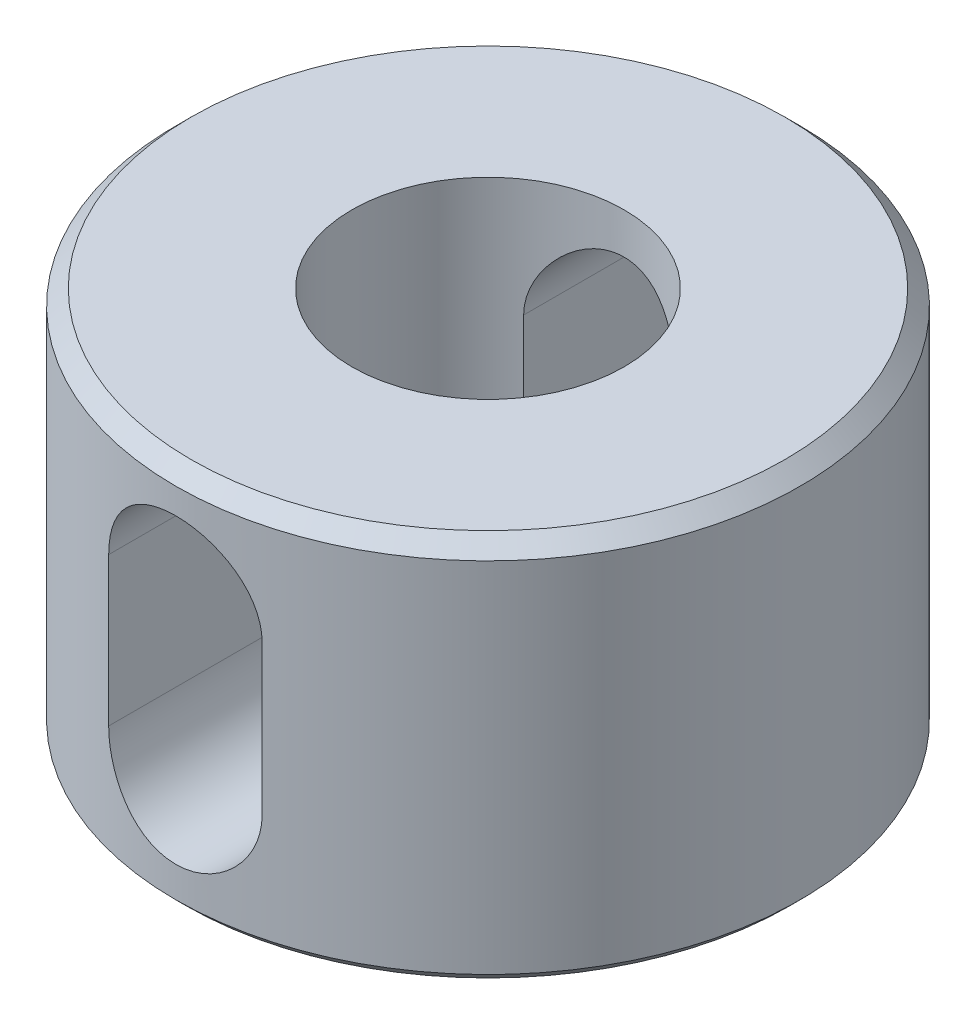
ISO-10303-21;
HEADER;
FILE_DESCRIPTION(('STEP AP214'),'2;1');
FILE_NAME('part.step','',(''),(''),'','','');
FILE_SCHEMA(('AUTOMOTIVE_DESIGN { 1 0 10303 214 1 1 1 1 }'));
ENDSEC;
DATA;
#1=APPLICATION_CONTEXT('core data for automotive mechanical design processes');
#2=APPLICATION_PROTOCOL_DEFINITION('international standard','automotive_design',2000,#1);
#3=PRODUCT_CONTEXT('',#1,'mechanical');
#4=PRODUCT('Part','Part','',(#3));
#5=PRODUCT_RELATED_PRODUCT_CATEGORY('part','',(#4));
#6=PRODUCT_DEFINITION_FORMATION('','',#4);
#7=PRODUCT_DEFINITION_CONTEXT('part definition',#1,'design');
#8=PRODUCT_DEFINITION('design','',#6,#7);
#9=PRODUCT_DEFINITION_SHAPE('','',#8);
#10=(LENGTH_UNIT() NAMED_UNIT(*) SI_UNIT(.MILLI.,.METRE.));
#11=(NAMED_UNIT(*) PLANE_ANGLE_UNIT() SI_UNIT($,.RADIAN.));
#12=(NAMED_UNIT(*) SI_UNIT($,.STERADIAN.) SOLID_ANGLE_UNIT());
#13=UNCERTAINTY_MEASURE_WITH_UNIT(LENGTH_MEASURE(1.E-05),#10,'distance_accuracy_value','');
#14=(GEOMETRIC_REPRESENTATION_CONTEXT(3) GLOBAL_UNCERTAINTY_ASSIGNED_CONTEXT((#13)) GLOBAL_UNIT_ASSIGNED_CONTEXT((#10,
#11,#12)) REPRESENTATION_CONTEXT('',''));
#15=CARTESIAN_POINT('',(0.,0.,0.));
#16=DIRECTION('',(0.,0.,1.));
#17=DIRECTION('',(1.,0.,0.));
#18=AXIS2_PLACEMENT_3D('',#15,#16,#17);
#19=CARTESIAN_POINT('',(0.,9.525,0.));
#20=DIRECTION('',(0.,-1.,0.));
#21=DIRECTION('',(0.,0.,-1.));
#22=AXIS2_PLACEMENT_3D('',#19,#20,#21);
#23=CYLINDRICAL_SURFACE('',#22,7.747);
#24=DIRECTION('',(0.,-1.,0.));
#25=VECTOR('',#24,1.);
#26=CARTESIAN_POINT('',(1.905,9.525,-7.50912671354));
#27=LINE('',#26,#25);
#28=CARTESIAN_POINT('',(1.905,2.921,-7.50912671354));
#29=VERTEX_POINT('',#28);
#30=CARTESIAN_POINT('',(1.905,6.604,-7.50912671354));
#31=VERTEX_POINT('',#30);
#32=EDGE_CURVE('E269',#29,#31,#27,.F.);
#33=ORIENTED_EDGE('',*,*,#32,.T.);
#34=CARTESIAN_POINT('',(1.905,6.604,-7.50912671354));
#35=CARTESIAN_POINT('',(1.90500061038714,6.6567274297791,-7.50912324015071));
#36=CARTESIAN_POINT('',(1.90280948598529,6.70942876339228,-7.50968278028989));
#37=CARTESIAN_POINT('',(1.89407453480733,6.81443787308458,-7.51189196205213));
#38=CARTESIAN_POINT('',(1.88753142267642,6.86674571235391,-7.5135414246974));
#39=CARTESIAN_POINT('',(1.86146822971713,7.02230024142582,-7.5200588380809));
#40=CARTESIAN_POINT('',(1.83551388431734,7.12447892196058,-7.52649621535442));
#41=CARTESIAN_POINT('',(1.76728311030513,7.32285711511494,-7.54280668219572));
#42=CARTESIAN_POINT('',(1.72500791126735,7.41905707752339,-7.552679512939));
#43=CARTESIAN_POINT('',(1.62538466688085,7.60304588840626,-7.57474279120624));
#44=CARTESIAN_POINT('',(1.56803280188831,7.69083259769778,-7.58693382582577));
#45=CARTESIAN_POINT('',(1.43859506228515,7.85731545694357,-7.61254728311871));
#46=CARTESIAN_POINT('',(1.36624936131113,7.93580661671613,-7.6259887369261));
#47=CARTESIAN_POINT('',(1.209430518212,8.07967858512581,-7.65242443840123));
#48=CARTESIAN_POINT('',(1.12495544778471,8.14505730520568,-7.66541861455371));
#49=CARTESIAN_POINT('',(0.944870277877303,8.26168048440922,-7.68970621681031));
#50=CARTESIAN_POINT('',(0.849125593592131,8.31272283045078,-7.70097439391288));
#51=CARTESIAN_POINT('',(0.650096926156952,8.39790929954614,-7.72032152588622));
#52=CARTESIAN_POINT('',(0.546814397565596,8.43205667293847,-7.72840109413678));
#53=CARTESIAN_POINT('',(0.337787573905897,8.48182836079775,-7.7403260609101));
#54=CARTESIAN_POINT('',(0.232131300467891,8.49780285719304,-7.74425140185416));
#55=CARTESIAN_POINT('',(0.0195681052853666,8.51187406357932,-7.74770403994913));
#56=CARTESIAN_POINT('',(-0.0873386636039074,8.50997293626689,-7.74723186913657));
#57=CARTESIAN_POINT('',(-0.296936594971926,8.48859926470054,-7.74200224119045));
#58=CARTESIAN_POINT('',(-0.399668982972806,8.46950502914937,-7.73733704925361));
#59=CARTESIAN_POINT('',(-0.600423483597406,8.41489471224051,-7.72435273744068));
#60=CARTESIAN_POINT('',(-0.698445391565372,8.37937791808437,-7.71603345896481));
#61=CARTESIAN_POINT('',(-0.888002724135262,8.29262024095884,-7.69653346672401));
#62=CARTESIAN_POINT('',(-0.979473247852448,8.24124331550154,-7.68532814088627));
#63=CARTESIAN_POINT('',(-1.15262550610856,8.12432772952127,-7.66127379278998));
#64=CARTESIAN_POINT('',(-1.23430582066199,8.05878701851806,-7.64842453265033));
#65=CARTESIAN_POINT('',(-1.38780832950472,7.91338098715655,-7.62208815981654));
#66=CARTESIAN_POINT('',(-1.45931763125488,7.83318647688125,-7.60859315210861));
#67=CARTESIAN_POINT('',(-1.58795807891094,7.66177892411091,-7.58279081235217));
#68=CARTESIAN_POINT('',(-1.64508529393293,7.57056287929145,-7.57048380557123));
#69=CARTESIAN_POINT('',(-1.74353569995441,7.37908809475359,-7.54842104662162));
#70=CARTESIAN_POINT('',(-1.78477688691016,7.27878565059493,-7.5386786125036));
#71=CARTESIAN_POINT('',(-1.84966237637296,7.07243407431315,-7.5230240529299));
#72=CARTESIAN_POINT('',(-1.87333296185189,6.96639378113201,-7.51710620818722));
#73=CARTESIAN_POINT('',(-1.89355353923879,6.81686774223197,-7.51202283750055));
#74=CARTESIAN_POINT('',(-1.89784677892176,6.77437933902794,-7.51093842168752));
#75=CARTESIAN_POINT('',(-1.90356674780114,6.68926732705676,-7.50949070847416));
#76=CARTESIAN_POINT('',(-1.9049981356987,6.64664405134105,-7.50912623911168));
#77=CARTESIAN_POINT('',(-1.905,6.604,-7.50912671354));
#78=B_SPLINE_CURVE_WITH_KNOTS('',3,(#34,#35,#36,#37,#38,#39,#40,#41,#42,#43,#44,#45,#46,#47,#48,
#49,#50,#51,#52,#53,#54,#55,#56,#57,#58,#59,#60,#61,#62,#63,#64,#65,#66,#67,#68,#69,#70,#71,#72,
#73,#74,#75,#76,#77),.UNSPECIFIED.,.F.,.F.,(4,2,2,2,2,2,2,2,2,2,2,2,2,2,2,2,2,2,2,2,2,4),(0.,
0.158082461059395,0.316138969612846,0.631360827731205,0.946558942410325,1.26183698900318,
1.58311999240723,1.9044541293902,2.23011385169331,2.55571089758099,2.87492154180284,
3.19409356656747,3.50640982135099,3.81873963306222,4.13382665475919,4.44895932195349,
4.77231592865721,5.09576081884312,5.42085365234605,5.74545921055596,5.87353314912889,
6.00139843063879),.UNSPECIFIED.);
#79=CARTESIAN_POINT('',(-1.905,6.604,-7.50912671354));
#80=VERTEX_POINT('',#79);
#81=EDGE_CURVE('E127',#31,#80,#78,.T.);
#82=ORIENTED_EDGE('',*,*,#81,.T.);
#83=DIRECTION('',(0.,-1.,0.));
#84=VECTOR('',#83,1.);
#85=CARTESIAN_POINT('',(-1.905,9.525,-7.50912671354));
#86=LINE('',#85,#84);
#87=CARTESIAN_POINT('',(-1.905,2.921,-7.50912671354));
#88=VERTEX_POINT('',#87);
#89=EDGE_CURVE('E201',#80,#88,#86,.T.);
#90=ORIENTED_EDGE('',*,*,#89,.T.);
#91=CARTESIAN_POINT('',(-1.905,2.921,-7.50912671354));
#92=CARTESIAN_POINT('',(-1.90500061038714,2.8682725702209,-7.50912324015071));
#93=CARTESIAN_POINT('',(-1.90280948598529,2.81557123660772,-7.50968278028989));
#94=CARTESIAN_POINT('',(-1.89407453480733,2.71056212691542,-7.51189196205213));
#95=CARTESIAN_POINT('',(-1.88753142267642,2.65825428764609,-7.5135414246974));
#96=CARTESIAN_POINT('',(-1.86146822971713,2.50269975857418,-7.5200588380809));
#97=CARTESIAN_POINT('',(-1.83551388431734,2.40052107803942,-7.52649621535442));
#98=CARTESIAN_POINT('',(-1.76728311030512,2.20214288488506,-7.54280668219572));
#99=CARTESIAN_POINT('',(-1.72500791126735,2.10594292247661,-7.552679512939));
#100=CARTESIAN_POINT('',(-1.62538466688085,1.92195411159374,-7.57474279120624));
#101=CARTESIAN_POINT('',(-1.56803280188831,1.83416740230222,-7.58693382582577));
#102=CARTESIAN_POINT('',(-1.43859506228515,1.66768454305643,-7.61254728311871));
#103=CARTESIAN_POINT('',(-1.36624936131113,1.58919338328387,-7.62598873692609));
#104=CARTESIAN_POINT('',(-1.209430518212,1.44532141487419,-7.65242443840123));
#105=CARTESIAN_POINT('',(-1.12495544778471,1.37994269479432,-7.66541861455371));
#106=CARTESIAN_POINT('',(-0.944870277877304,1.26331951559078,-7.68970621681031));
#107=CARTESIAN_POINT('',(-0.849125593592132,1.21227716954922,-7.70097439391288));
#108=CARTESIAN_POINT('',(-0.650096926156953,1.12709070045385,-7.72032152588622));
#109=CARTESIAN_POINT('',(-0.546814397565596,1.09294332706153,-7.72840109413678));
#110=CARTESIAN_POINT('',(-0.337787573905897,1.04317163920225,-7.7403260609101));
#111=CARTESIAN_POINT('',(-0.232131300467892,1.02719714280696,-7.74425140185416));
#112=CARTESIAN_POINT('',(-0.0195681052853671,1.01312593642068,-7.74770403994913));
#113=CARTESIAN_POINT('',(0.0873386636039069,1.01502706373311,-7.74723186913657));
#114=CARTESIAN_POINT('',(0.296936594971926,1.03640073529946,-7.74200224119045));
#115=CARTESIAN_POINT('',(0.399668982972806,1.05549497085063,-7.73733704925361));
#116=CARTESIAN_POINT('',(0.600423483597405,1.11010528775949,-7.72435273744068));
#117=CARTESIAN_POINT('',(0.698445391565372,1.14562208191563,-7.71603345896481));
#118=CARTESIAN_POINT('',(0.888002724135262,1.23237975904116,-7.69653346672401));
#119=CARTESIAN_POINT('',(0.979473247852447,1.28375668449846,-7.68532814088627));
#120=CARTESIAN_POINT('',(1.15262550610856,1.40067227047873,-7.66127379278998));
#121=CARTESIAN_POINT('',(1.23430582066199,1.46621298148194,-7.64842453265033));
#122=CARTESIAN_POINT('',(1.38780832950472,1.61161901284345,-7.62208815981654));
#123=CARTESIAN_POINT('',(1.45931763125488,1.69181352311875,-7.60859315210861));
#124=CARTESIAN_POINT('',(1.58795807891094,1.86322107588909,-7.58279081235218));
#125=CARTESIAN_POINT('',(1.64508529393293,1.95443712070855,-7.57048380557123));
#126=CARTESIAN_POINT('',(1.74353569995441,2.14591190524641,-7.54842104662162));
#127=CARTESIAN_POINT('',(1.78477688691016,2.24621434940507,-7.5386786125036));
#128=CARTESIAN_POINT('',(1.84966237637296,2.45256592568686,-7.5230240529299));
#129=CARTESIAN_POINT('',(1.87333296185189,2.55860621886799,-7.51710620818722));
#130=CARTESIAN_POINT('',(1.89355353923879,2.70813225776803,-7.51202283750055));
#131=CARTESIAN_POINT('',(1.89784677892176,2.75062066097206,-7.51093842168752));
#132=CARTESIAN_POINT('',(1.90356674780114,2.83573267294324,-7.50949070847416));
#133=CARTESIAN_POINT('',(1.9049981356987,2.87835594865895,-7.50912623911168));
#134=CARTESIAN_POINT('',(1.905,2.921,-7.50912671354));
#135=B_SPLINE_CURVE_WITH_KNOTS('',3,(#91,#92,#93,#94,#95,#96,#97,#98,#99,#100,#101,#102,#103,
#104,#105,#106,#107,#108,#109,#110,#111,#112,#113,#114,#115,#116,#117,#118,#119,#120,#121,#122,
#123,#124,#125,#126,#127,#128,#129,#130,#131,#132,#133,#134),.UNSPECIFIED.,.F.,.F.,(4,2,2,2,2,2,
2,2,2,2,2,2,2,2,2,2,2,2,2,2,2,4),(0.,0.158082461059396,0.316138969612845,0.631360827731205,
0.946558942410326,1.26183698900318,1.58311999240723,1.9044541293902,2.23011385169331,
2.55571089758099,2.87492154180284,3.19409356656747,3.50640982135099,3.81873963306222,
4.13382665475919,4.44895932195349,4.77231592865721,5.09576081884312,5.42085365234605,
5.74545921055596,5.87353314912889,6.00139843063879),.UNSPECIFIED.);
#136=EDGE_CURVE('E194',#88,#29,#135,.T.);
#137=ORIENTED_EDGE('',*,*,#136,.T.);
#138=EDGE_LOOP('',(#33,#82,#90,#137));
#139=FACE_BOUND('',#138,.T.);
#140=DIRECTION('',(0.,-1.,0.));
#141=VECTOR('',#140,1.);
#142=CARTESIAN_POINT('',(-1.905,9.525,7.50912671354));
#143=LINE('',#142,#141);
#144=CARTESIAN_POINT('',(-1.905,2.921,7.50912671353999));
#145=VERTEX_POINT('',#144);
#146=CARTESIAN_POINT('',(-1.905,6.604,7.50912671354));
#147=VERTEX_POINT('',#146);
#148=EDGE_CURVE('E258',#145,#147,#143,.F.);
#149=ORIENTED_EDGE('',*,*,#148,.T.);
#150=CARTESIAN_POINT('',(-1.905,6.604,7.50912671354));
#151=CARTESIAN_POINT('',(-1.90500061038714,6.6567274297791,7.50912324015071));
#152=CARTESIAN_POINT('',(-1.90280948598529,6.70942876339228,7.50968278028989));
#153=CARTESIAN_POINT('',(-1.89407453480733,6.81443787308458,7.51189196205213));
#154=CARTESIAN_POINT('',(-1.88753142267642,6.86674571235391,7.5135414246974));
#155=CARTESIAN_POINT('',(-1.86146822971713,7.02230024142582,7.5200588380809));
#156=CARTESIAN_POINT('',(-1.83551388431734,7.12447892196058,7.52649621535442));
#157=CARTESIAN_POINT('',(-1.76728311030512,7.32285711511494,7.54280668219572));
#158=CARTESIAN_POINT('',(-1.72500791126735,7.41905707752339,7.552679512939));
#159=CARTESIAN_POINT('',(-1.62538466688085,7.60304588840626,7.57474279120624));
#160=CARTESIAN_POINT('',(-1.56803280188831,7.69083259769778,7.58693382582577));
#161=CARTESIAN_POINT('',(-1.43859506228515,7.85731545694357,7.61254728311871));
#162=CARTESIAN_POINT('',(-1.36624936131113,7.93580661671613,7.6259887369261));
#163=CARTESIAN_POINT('',(-1.209430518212,8.07967858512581,7.65242443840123));
#164=CARTESIAN_POINT('',(-1.12495544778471,8.14505730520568,7.66541861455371));
#165=CARTESIAN_POINT('',(-0.944870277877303,8.26168048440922,7.68970621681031));
#166=CARTESIAN_POINT('',(-0.849125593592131,8.31272283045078,7.70097439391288));
#167=CARTESIAN_POINT('',(-0.650096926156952,8.39790929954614,7.72032152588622));
#168=CARTESIAN_POINT('',(-0.546814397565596,8.43205667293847,7.72840109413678));
#169=CARTESIAN_POINT('',(-0.337787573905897,8.48182836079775,7.7403260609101));
#170=CARTESIAN_POINT('',(-0.232131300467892,8.49780285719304,7.74425140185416));
#171=CARTESIAN_POINT('',(-0.0195681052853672,8.51187406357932,7.74770403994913));
#172=CARTESIAN_POINT('',(0.0873386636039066,8.50997293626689,7.74723186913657));
#173=CARTESIAN_POINT('',(0.296936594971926,8.48859926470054,7.74200224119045));
#174=CARTESIAN_POINT('',(0.399668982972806,8.46950502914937,7.73733704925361));
#175=CARTESIAN_POINT('',(0.600423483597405,8.41489471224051,7.72435273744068));
#176=CARTESIAN_POINT('',(0.698445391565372,8.37937791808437,7.71603345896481));
#177=CARTESIAN_POINT('',(0.888002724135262,8.29262024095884,7.69653346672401));
#178=CARTESIAN_POINT('',(0.979473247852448,8.24124331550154,7.68532814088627));
#179=CARTESIAN_POINT('',(1.15262550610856,8.12432772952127,7.66127379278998));
#180=CARTESIAN_POINT('',(1.23430582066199,8.05878701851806,7.64842453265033));
#181=CARTESIAN_POINT('',(1.38780832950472,7.91338098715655,7.62208815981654));
#182=CARTESIAN_POINT('',(1.45931763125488,7.83318647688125,7.60859315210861));
#183=CARTESIAN_POINT('',(1.58795807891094,7.66177892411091,7.58279081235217));
#184=CARTESIAN_POINT('',(1.64508529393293,7.57056287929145,7.57048380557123));
#185=CARTESIAN_POINT('',(1.74353569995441,7.37908809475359,7.54842104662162));
#186=CARTESIAN_POINT('',(1.78477688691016,7.27878565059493,7.5386786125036));
#187=CARTESIAN_POINT('',(1.84966237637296,7.07243407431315,7.5230240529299));
#188=CARTESIAN_POINT('',(1.87333296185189,6.96639378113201,7.51710620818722));
#189=CARTESIAN_POINT('',(1.89355353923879,6.81686774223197,7.51202283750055));
#190=CARTESIAN_POINT('',(1.89784677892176,6.77437933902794,7.51093842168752));
#191=CARTESIAN_POINT('',(1.90356674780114,6.68926732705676,7.50949070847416));
#192=CARTESIAN_POINT('',(1.9049981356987,6.64664405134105,7.50912623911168));
#193=CARTESIAN_POINT('',(1.905,6.604,7.50912671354));
#194=B_SPLINE_CURVE_WITH_KNOTS('',3,(#150,#151,#152,#153,#154,#155,#156,#157,#158,#159,#160,
#161,#162,#163,#164,#165,#166,#167,#168,#169,#170,#171,#172,#173,#174,#175,#176,#177,#178,#179,
#180,#181,#182,#183,#184,#185,#186,#187,#188,#189,#190,#191,#192,#193),.UNSPECIFIED.,.F.,.F.,(4,
2,2,2,2,2,2,2,2,2,2,2,2,2,2,2,2,2,2,2,2,4),(0.,0.158082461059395,0.316138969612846,
0.631360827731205,0.946558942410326,1.26183698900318,1.58311999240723,1.9044541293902,
2.23011385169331,2.55571089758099,2.87492154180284,3.19409356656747,3.50640982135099,
3.81873963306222,4.13382665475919,4.44895932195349,4.77231592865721,5.09576081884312,
5.42085365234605,5.74545921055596,5.87353314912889,6.00139843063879),.UNSPECIFIED.);
#195=CARTESIAN_POINT('',(1.905,6.604,7.50912671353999));
#196=VERTEX_POINT('',#195);
#197=EDGE_CURVE('E173',#147,#196,#194,.T.);
#198=ORIENTED_EDGE('',*,*,#197,.T.);
#199=DIRECTION('',(0.,-1.,0.));
#200=VECTOR('',#199,1.);
#201=CARTESIAN_POINT('',(1.905,9.525,7.50912671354));
#202=LINE('',#201,#200);
#203=CARTESIAN_POINT('',(1.905,2.921,7.50912671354));
#204=VERTEX_POINT('',#203);
#205=EDGE_CURVE('E174',#196,#204,#202,.T.);
#206=ORIENTED_EDGE('',*,*,#205,.T.);
#207=CARTESIAN_POINT('',(1.905,2.921,7.50912671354));
#208=CARTESIAN_POINT('',(1.90500061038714,2.8682725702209,7.50912324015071));
#209=CARTESIAN_POINT('',(1.90280948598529,2.81557123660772,7.50968278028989));
#210=CARTESIAN_POINT('',(1.89407453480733,2.71056212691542,7.51189196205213));
#211=CARTESIAN_POINT('',(1.88753142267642,2.65825428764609,7.5135414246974));
#212=CARTESIAN_POINT('',(1.86146822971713,2.50269975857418,7.5200588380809));
#213=CARTESIAN_POINT('',(1.83551388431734,2.40052107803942,7.52649621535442));
#214=CARTESIAN_POINT('',(1.76728311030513,2.20214288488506,7.54280668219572));
#215=CARTESIAN_POINT('',(1.72500791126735,2.10594292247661,7.552679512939));
#216=CARTESIAN_POINT('',(1.62538466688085,1.92195411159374,7.57474279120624));
#217=CARTESIAN_POINT('',(1.56803280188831,1.83416740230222,7.58693382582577));
#218=CARTESIAN_POINT('',(1.43859506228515,1.66768454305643,7.61254728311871));
#219=CARTESIAN_POINT('',(1.36624936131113,1.58919338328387,7.62598873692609));
#220=CARTESIAN_POINT('',(1.209430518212,1.44532141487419,7.65242443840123));
#221=CARTESIAN_POINT('',(1.12495544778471,1.37994269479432,7.66541861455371));
#222=CARTESIAN_POINT('',(0.944870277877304,1.26331951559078,7.68970621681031));
#223=CARTESIAN_POINT('',(0.849125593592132,1.21227716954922,7.70097439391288));
#224=CARTESIAN_POINT('',(0.650096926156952,1.12709070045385,7.72032152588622));
#225=CARTESIAN_POINT('',(0.546814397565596,1.09294332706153,7.72840109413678));
#226=CARTESIAN_POINT('',(0.337787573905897,1.04317163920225,7.7403260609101));
#227=CARTESIAN_POINT('',(0.232131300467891,1.02719714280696,7.74425140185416));
#228=CARTESIAN_POINT('',(0.0195681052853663,1.01312593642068,7.74770403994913));
#229=CARTESIAN_POINT('',(-0.0873386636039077,1.01502706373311,7.74723186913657));
#230=CARTESIAN_POINT('',(-0.296936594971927,1.03640073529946,7.74200224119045));
#231=CARTESIAN_POINT('',(-0.399668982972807,1.05549497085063,7.73733704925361));
#232=CARTESIAN_POINT('',(-0.600423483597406,1.11010528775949,7.72435273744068));
#233=CARTESIAN_POINT('',(-0.698445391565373,1.14562208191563,7.71603345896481));
#234=CARTESIAN_POINT('',(-0.888002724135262,1.23237975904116,7.69653346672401));
#235=CARTESIAN_POINT('',(-0.979473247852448,1.28375668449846,7.68532814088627));
#236=CARTESIAN_POINT('',(-1.15262550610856,1.40067227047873,7.66127379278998));
#237=CARTESIAN_POINT('',(-1.23430582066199,1.46621298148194,7.64842453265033));
#238=CARTESIAN_POINT('',(-1.38780832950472,1.61161901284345,7.62208815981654));
#239=CARTESIAN_POINT('',(-1.45931763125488,1.69181352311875,7.60859315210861));
#240=CARTESIAN_POINT('',(-1.58795807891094,1.86322107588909,7.58279081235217));
#241=CARTESIAN_POINT('',(-1.64508529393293,1.95443712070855,7.57048380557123));
#242=CARTESIAN_POINT('',(-1.74353569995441,2.14591190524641,7.54842104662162));
#243=CARTESIAN_POINT('',(-1.78477688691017,2.24621434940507,7.5386786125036));
#244=CARTESIAN_POINT('',(-1.84966237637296,2.45256592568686,7.5230240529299));
#245=CARTESIAN_POINT('',(-1.87333296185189,2.55860621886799,7.51710620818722));
#246=CARTESIAN_POINT('',(-1.89355353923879,2.70813225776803,7.51202283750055));
#247=CARTESIAN_POINT('',(-1.89784677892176,2.75062066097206,7.51093842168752));
#248=CARTESIAN_POINT('',(-1.90356674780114,2.83573267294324,7.50949070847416));
#249=CARTESIAN_POINT('',(-1.9049981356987,2.87835594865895,7.50912623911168));
#250=CARTESIAN_POINT('',(-1.905,2.921,7.50912671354));
#251=B_SPLINE_CURVE_WITH_KNOTS('',3,(#207,#208,#209,#210,#211,#212,#213,#214,#215,#216,#217,
#218,#219,#220,#221,#222,#223,#224,#225,#226,#227,#228,#229,#230,#231,#232,#233,#234,#235,#236,
#237,#238,#239,#240,#241,#242,#243,#244,#245,#246,#247,#248,#249,#250),.UNSPECIFIED.,.F.,.F.,(4,
2,2,2,2,2,2,2,2,2,2,2,2,2,2,2,2,2,2,2,2,4),(0.,0.158082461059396,0.316138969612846,
0.631360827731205,0.946558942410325,1.26183698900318,1.58311999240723,1.9044541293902,
2.23011385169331,2.55571089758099,2.87492154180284,3.19409356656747,3.50640982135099,
3.81873963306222,4.13382665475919,4.44895932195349,4.77231592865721,5.09576081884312,
5.42085365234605,5.74545921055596,5.8735331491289,6.00139843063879),.UNSPECIFIED.);
#252=EDGE_CURVE('E200',#204,#145,#251,.T.);
#253=ORIENTED_EDGE('',*,*,#252,.T.);
#254=EDGE_LOOP('',(#149,#198,#206,#253));
#255=FACE_BOUND('',#254,.T.);
#256=CARTESIAN_POINT('',(0.,9.14400000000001,0.));
#257=DIRECTION('',(0.,1.,0.));
#258=DIRECTION('',(0.,0.,1.));
#259=AXIS2_PLACEMENT_3D('',#256,#257,#258);
#260=CIRCLE('',#259,7.747);
#261=CARTESIAN_POINT('',(0.,9.144,-7.747));
#262=VERTEX_POINT('',#261);
#263=EDGE_CURVE('E228',#262,#262,#260,.F.);
#264=ORIENTED_EDGE('',*,*,#263,.T.);
#265=EDGE_LOOP('',(#264));
#266=FACE_BOUND('',#265,.T.);
#267=CARTESIAN_POINT('',(0.,0.254000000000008,0.));
#268=DIRECTION('',(0.,1.,0.));
#269=DIRECTION('',(0.,0.,1.));
#270=AXIS2_PLACEMENT_3D('',#267,#268,#269);
#271=CIRCLE('',#270,7.747);
#272=CARTESIAN_POINT('',(0.,0.254000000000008,7.747));
#273=VERTEX_POINT('',#272);
#274=EDGE_CURVE('E243',#273,#273,#271,.T.);
#275=ORIENTED_EDGE('',*,*,#274,.T.);
#276=EDGE_LOOP('',(#275));
#277=FACE_BOUND('',#276,.T.);
#278=ADVANCED_FACE('F41',(#139,#255,#266,#277),#23,.T.);
#279=CARTESIAN_POINT('',(0.,9.525,0.));
#280=DIRECTION('',(0.,1.,0.));
#281=DIRECTION('',(0.,0.,1.));
#282=AXIS2_PLACEMENT_3D('',#279,#280,#281);
#283=PLANE('',#282);
#284=CARTESIAN_POINT('',(0.,9.525,0.));
#285=DIRECTION('',(0.,1.,0.));
#286=DIRECTION('',(0.,0.,1.));
#287=AXIS2_PLACEMENT_3D('',#284,#285,#286);
#288=CIRCLE('',#287,7.36600000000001);
#289=CARTESIAN_POINT('',(0.,9.525,-7.36600000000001));
#290=VERTEX_POINT('',#289);
#291=EDGE_CURVE('E230',#290,#290,#288,.T.);
#292=ORIENTED_EDGE('',*,*,#291,.T.);
#293=EDGE_LOOP('',(#292));
#294=FACE_BOUND('',#293,.T.);
#295=CARTESIAN_POINT('',(0.,9.525,0.));
#296=DIRECTION('',(0.,1.,0.));
#297=DIRECTION('',(0.,0.,1.));
#298=AXIS2_PLACEMENT_3D('',#295,#296,#297);
#299=CIRCLE('',#298,3.3782);
#300=CARTESIAN_POINT('',(0.,9.525,3.3782));
#301=VERTEX_POINT('',#300);
#302=EDGE_CURVE('E235',#301,#301,#299,.T.);
#303=ORIENTED_EDGE('',*,*,#302,.F.);
#304=EDGE_LOOP('',(#303));
#305=FACE_BOUND('',#304,.T.);
#306=ADVANCED_FACE('F184',(#294,#305),#283,.T.);
#307=CARTESIAN_POINT('',(0.,0.,0.));
#308=DIRECTION('',(0.,1.,0.));
#309=DIRECTION('',(0.,0.,1.));
#310=AXIS2_PLACEMENT_3D('',#307,#308,#309);
#311=PLANE('',#310);
#312=CARTESIAN_POINT('',(0.,0.,0.));
#313=DIRECTION('',(0.,-1.,0.));
#314=DIRECTION('',(0.,0.,-1.));
#315=AXIS2_PLACEMENT_3D('',#312,#313,#314);
#316=CIRCLE('',#315,1.5875);
#317=CARTESIAN_POINT('',(0.,0.,-1.5875));
#318=VERTEX_POINT('',#317);
#319=EDGE_CURVE('E236',#318,#318,#316,.T.);
#320=ORIENTED_EDGE('',*,*,#319,.F.);
#321=EDGE_LOOP('',(#320));
#322=FACE_BOUND('',#321,.T.);
#323=CARTESIAN_POINT('',(0.,0.,0.));
#324=DIRECTION('',(0.,1.,0.));
#325=DIRECTION('',(0.,0.,1.));
#326=AXIS2_PLACEMENT_3D('',#323,#324,#325);
#327=CIRCLE('',#326,7.49299999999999);
#328=CARTESIAN_POINT('',(0.,0.,7.49299999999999));
#329=VERTEX_POINT('',#328);
#330=EDGE_CURVE('E240',#329,#329,#327,.F.);
#331=ORIENTED_EDGE('',*,*,#330,.T.);
#332=EDGE_LOOP('',(#331));
#333=FACE_BOUND('',#332,.T.);
#334=ADVANCED_FACE('F186',(#322,#333),#311,.F.);
#335=CARTESIAN_POINT('',(0.,0.635,0.));
#336=DIRECTION('',(0.,1.,0.));
#337=DIRECTION('',(0.,0.,1.));
#338=AXIS2_PLACEMENT_3D('',#335,#336,#337);
#339=CYLINDRICAL_SURFACE('',#338,3.3782);
#340=DIRECTION('',(0.,1.,0.));
#341=VECTOR('',#340,1.);
#342=CARTESIAN_POINT('',(1.905,0.635,-2.78984054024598));
#343=LINE('',#342,#341);
#344=CARTESIAN_POINT('',(1.905,6.604,-2.78984054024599));
#345=VERTEX_POINT('',#344);
#346=CARTESIAN_POINT('',(1.905,2.921,-2.78984054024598));
#347=VERTEX_POINT('',#346);
#348=EDGE_CURVE('E113',#345,#347,#343,.F.);
#349=ORIENTED_EDGE('',*,*,#348,.T.);
#350=CARTESIAN_POINT('',(1.905,2.921,-2.78984054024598));
#351=CARTESIAN_POINT('',(1.90501006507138,2.87216149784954,-2.78982245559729));
#352=CARTESIAN_POINT('',(1.90312228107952,2.82333336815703,-2.7911225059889));
#353=CARTESIAN_POINT('',(1.89563072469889,2.72613352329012,-2.79622181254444));
#354=CARTESIAN_POINT('',(1.89003001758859,2.67776146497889,-2.80001900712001));
#355=CARTESIAN_POINT('',(1.87524491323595,2.58216914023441,-2.8099405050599));
#356=CARTESIAN_POINT('',(1.86608631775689,2.53494312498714,-2.8160480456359));
#357=CARTESIAN_POINT('',(1.84432104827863,2.4416221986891,-2.83035064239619));
#358=CARTESIAN_POINT('',(1.83171380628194,2.39552747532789,-2.83854604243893));
#359=CARTESIAN_POINT('',(1.7890290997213,2.25965386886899,-2.86578991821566));
#360=CARTESIAN_POINT('',(1.75402907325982,2.17191037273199,-2.88753872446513));
#361=CARTESIAN_POINT('',(1.67212028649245,2.00347608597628,-2.93572852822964));
#362=CARTESIAN_POINT('',(1.62518778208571,1.92279979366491,-2.96217884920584));
#363=CARTESIAN_POINT('',(1.51495663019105,1.76149585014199,-3.02016785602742));
#364=CARTESIAN_POINT('',(1.45045125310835,1.68177783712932,-3.0519487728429));
#365=CARTESIAN_POINT('',(1.30941079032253,1.53357762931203,-3.11506853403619));
#366=CARTESIAN_POINT('',(1.23287179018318,1.46509910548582,-3.14640723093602));
#367=CARTESIAN_POINT('',(1.06137799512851,1.33509138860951,-3.20854522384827));
#368=CARTESIAN_POINT('',(0.965377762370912,1.2747766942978,-3.23903107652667));
#369=CARTESIAN_POINT('',(0.762544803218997,1.17158144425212,-3.29267808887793));
#370=CARTESIAN_POINT('',(0.655720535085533,1.12868740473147,-3.31584491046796));
#371=CARTESIAN_POINT('',(0.444059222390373,1.06547973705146,-3.35045235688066));
#372=CARTESIAN_POINT('',(0.339851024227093,1.04353251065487,-3.36273463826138));
#373=CARTESIAN_POINT('',(0.128573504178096,1.01737260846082,-3.37740775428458));
#374=CARTESIAN_POINT('',(0.0215065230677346,1.0131458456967,-3.37980644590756));
#375=CARTESIAN_POINT('',(-0.179788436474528,1.02212593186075,-3.37474891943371));
#376=CARTESIAN_POINT('',(-0.274134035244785,1.03346752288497,-3.36834698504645));
#377=CARTESIAN_POINT('',(-0.459319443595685,1.06979659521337,-3.34812433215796));
#378=CARTESIAN_POINT('',(-0.550159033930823,1.09478492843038,-3.33430315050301));
#379=CARTESIAN_POINT('',(-0.72696756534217,1.15764008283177,-3.30029476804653));
#380=CARTESIAN_POINT('',(-0.81288143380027,1.19562812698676,-3.28004778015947));
#381=CARTESIAN_POINT('',(-0.977267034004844,1.28311921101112,-3.23488195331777));
#382=CARTESIAN_POINT('',(-1.0557365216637,1.33262570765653,-3.20996171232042));
#383=CARTESIAN_POINT('',(-1.21234314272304,1.44799879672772,-3.15437891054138));
#384=CARTESIAN_POINT('',(-1.28947367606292,1.5150722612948,-3.12338596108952));
#385=CARTESIAN_POINT('',(-1.43201641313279,1.66054597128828,-3.06066066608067));
#386=CARTESIAN_POINT('',(-1.49741280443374,1.73896124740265,-3.0289273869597));
#387=CARTESIAN_POINT('',(-1.62090294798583,1.91390571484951,-2.96482666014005));
#388=CARTESIAN_POINT('',(-1.67769014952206,2.01145159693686,-2.93269155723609));
#389=CARTESIAN_POINT('',(-1.77358989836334,2.2166195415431,-2.87571672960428));
#390=CARTESIAN_POINT('',(-1.8127562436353,2.32420970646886,-2.85085488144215));
#391=CARTESIAN_POINT('',(-1.86270275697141,2.51366975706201,-2.81836461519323));
#392=CARTESIAN_POINT('',(-1.87845304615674,2.59373052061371,-2.80781368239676));
#393=CARTESIAN_POINT('',(-1.89432213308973,2.71543515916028,-2.79710866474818));
#394=CARTESIAN_POINT('',(-1.89831930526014,2.75637847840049,-2.79439356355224));
#395=CARTESIAN_POINT('',(-1.9036607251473,2.83854288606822,-2.79075538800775));
#396=CARTESIAN_POINT('',(-1.90500326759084,2.87976413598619,-2.78983346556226));
#397=CARTESIAN_POINT('',(-1.905,2.921,-2.78984054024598));
#398=B_SPLINE_CURVE_WITH_KNOTS('',3,(#350,#351,#352,#353,#354,#355,#356,#357,#358,#359,#360,
#361,#362,#363,#364,#365,#366,#367,#368,#369,#370,#371,#372,#373,#374,#375,#376,#377,#378,#379,
#380,#381,#382,#383,#384,#385,#386,#387,#388,#389,#390,#391,#392,#393,#394,#395,#396,#397),
.UNSPECIFIED.,.F.,.F.,(4,2,2,2,2,2,2,2,2,2,2,2,2,2,2,2,2,2,2,2,2,2,2,4),(0.,0.146444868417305,
0.292768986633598,0.438051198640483,0.583357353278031,0.872837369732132,1.16289798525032,
1.48367124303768,1.80454906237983,2.15487467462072,2.50492861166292,2.82467201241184,
3.14416118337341,3.42853162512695,3.71291982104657,4.00003567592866,4.28723780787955,
4.60636603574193,4.92592112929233,5.27619861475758,5.62539929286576,5.87127608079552,
5.9948445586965,6.11849238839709),.UNSPECIFIED.);
#399=CARTESIAN_POINT('',(-1.905,2.921,-2.78984054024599));
#400=VERTEX_POINT('',#399);
#401=EDGE_CURVE('E11',#347,#400,#398,.T.);
#402=ORIENTED_EDGE('',*,*,#401,.T.);
#403=DIRECTION('',(0.,1.,0.));
#404=VECTOR('',#403,1.);
#405=CARTESIAN_POINT('',(-1.905,0.635,-2.78984054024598));
#406=LINE('',#405,#404);
#407=CARTESIAN_POINT('',(-1.905,6.604,-2.78984054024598));
#408=VERTEX_POINT('',#407);
#409=EDGE_CURVE('E56',#400,#408,#406,.T.);
#410=ORIENTED_EDGE('',*,*,#409,.T.);
#411=CARTESIAN_POINT('',(-1.905,6.604,-2.78984054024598));
#412=CARTESIAN_POINT('',(-1.90501006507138,6.65283850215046,-2.78982245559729));
#413=CARTESIAN_POINT('',(-1.90312228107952,6.70166663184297,-2.7911225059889));
#414=CARTESIAN_POINT('',(-1.89563072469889,6.79886647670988,-2.79622181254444));
#415=CARTESIAN_POINT('',(-1.89003001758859,6.84723853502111,-2.80001900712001));
#416=CARTESIAN_POINT('',(-1.87524491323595,6.94283085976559,-2.8099405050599));
#417=CARTESIAN_POINT('',(-1.86608631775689,6.99005687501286,-2.8160480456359));
#418=CARTESIAN_POINT('',(-1.84432104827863,7.0833778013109,-2.83035064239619));
#419=CARTESIAN_POINT('',(-1.83171380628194,7.12947252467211,-2.83854604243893));
#420=CARTESIAN_POINT('',(-1.7890290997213,7.26534613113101,-2.86578991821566));
#421=CARTESIAN_POINT('',(-1.75402907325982,7.35308962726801,-2.88753872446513));
#422=CARTESIAN_POINT('',(-1.67212028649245,7.52152391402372,-2.93572852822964));
#423=CARTESIAN_POINT('',(-1.62518778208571,7.60220020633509,-2.96217884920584));
#424=CARTESIAN_POINT('',(-1.51495663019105,7.76350414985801,-3.02016785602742));
#425=CARTESIAN_POINT('',(-1.45045125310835,7.84322216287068,-3.0519487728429));
#426=CARTESIAN_POINT('',(-1.30941079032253,7.99142237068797,-3.11506853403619));
#427=CARTESIAN_POINT('',(-1.23287179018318,8.05990089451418,-3.14640723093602));
#428=CARTESIAN_POINT('',(-1.06137799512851,8.18990861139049,-3.20854522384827));
#429=CARTESIAN_POINT('',(-0.965377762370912,8.2502233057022,-3.23903107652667));
#430=CARTESIAN_POINT('',(-0.762544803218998,8.35341855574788,-3.29267808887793));
#431=CARTESIAN_POINT('',(-0.655720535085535,8.39631259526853,-3.31584491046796));
#432=CARTESIAN_POINT('',(-0.444059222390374,8.45952026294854,-3.35045235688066));
#433=CARTESIAN_POINT('',(-0.339851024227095,8.48146748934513,-3.36273463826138));
#434=CARTESIAN_POINT('',(-0.128573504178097,8.50762739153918,-3.37740775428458));
#435=CARTESIAN_POINT('',(-0.0215065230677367,8.5118541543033,-3.37980644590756));
#436=CARTESIAN_POINT('',(0.179788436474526,8.50287406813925,-3.37474891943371));
#437=CARTESIAN_POINT('',(0.274134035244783,8.49153247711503,-3.36834698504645));
#438=CARTESIAN_POINT('',(0.459319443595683,8.45520340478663,-3.34812433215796));
#439=CARTESIAN_POINT('',(0.550159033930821,8.43021507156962,-3.33430315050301));
#440=CARTESIAN_POINT('',(0.726967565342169,8.36735991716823,-3.30029476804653));
#441=CARTESIAN_POINT('',(0.812881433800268,8.32937187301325,-3.28004778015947));
#442=CARTESIAN_POINT('',(0.977267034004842,8.24188078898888,-3.23488195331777));
#443=CARTESIAN_POINT('',(1.0557365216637,8.19237429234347,-3.20996171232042));
#444=CARTESIAN_POINT('',(1.21234314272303,8.07700120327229,-3.15437891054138));
#445=CARTESIAN_POINT('',(1.28947367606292,8.0099277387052,-3.12338596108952));
#446=CARTESIAN_POINT('',(1.43201641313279,7.86445402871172,-3.06066066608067));
#447=CARTESIAN_POINT('',(1.49741280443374,7.78603875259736,-3.0289273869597));
#448=CARTESIAN_POINT('',(1.62090294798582,7.61109428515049,-2.96482666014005));
#449=CARTESIAN_POINT('',(1.67769014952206,7.51354840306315,-2.93269155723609));
#450=CARTESIAN_POINT('',(1.77358989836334,7.3083804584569,-2.87571672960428));
#451=CARTESIAN_POINT('',(1.8127562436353,7.20079029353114,-2.85085488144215));
#452=CARTESIAN_POINT('',(1.86270275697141,7.01133024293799,-2.81836461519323));
#453=CARTESIAN_POINT('',(1.87845304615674,6.93126947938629,-2.80781368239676));
#454=CARTESIAN_POINT('',(1.89432213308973,6.80956484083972,-2.79710866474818));
#455=CARTESIAN_POINT('',(1.89831930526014,6.76862152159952,-2.79439356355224));
#456=CARTESIAN_POINT('',(1.9036607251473,6.68645711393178,-2.79075538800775));
#457=CARTESIAN_POINT('',(1.90500326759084,6.64523586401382,-2.78983346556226));
#458=CARTESIAN_POINT('',(1.905,6.604,-2.78984054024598));
#459=B_SPLINE_CURVE_WITH_KNOTS('',3,(#411,#412,#413,#414,#415,#416,#417,#418,#419,#420,#421,
#422,#423,#424,#425,#426,#427,#428,#429,#430,#431,#432,#433,#434,#435,#436,#437,#438,#439,#440,
#441,#442,#443,#444,#445,#446,#447,#448,#449,#450,#451,#452,#453,#454,#455,#456,#457,#458),
.UNSPECIFIED.,.F.,.F.,(4,2,2,2,2,2,2,2,2,2,2,2,2,2,2,2,2,2,2,2,2,2,2,4),(0.,0.146444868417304,
0.292768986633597,0.438051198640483,0.583357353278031,0.872837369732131,1.16289798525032,
1.48367124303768,1.80454906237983,2.15487467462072,2.50492861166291,2.82467201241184,
3.14416118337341,3.42853162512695,3.71291982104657,4.00003567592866,4.28723780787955,
4.60636603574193,4.92592112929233,5.27619861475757,5.62539929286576,5.87127608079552,
5.9948445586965,6.11849238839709),.UNSPECIFIED.);
#460=EDGE_CURVE('E120',#408,#345,#459,.T.);
#461=ORIENTED_EDGE('',*,*,#460,.T.);
#462=EDGE_LOOP('',(#349,#402,#410,#461));
#463=FACE_BOUND('',#462,.T.);
#464=DIRECTION('',(0.,1.,0.));
#465=VECTOR('',#464,1.);
#466=CARTESIAN_POINT('',(-1.905,0.635,2.78984054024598));
#467=LINE('',#466,#465);
#468=CARTESIAN_POINT('',(-1.905,6.604,2.78984054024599));
#469=VERTEX_POINT('',#468);
#470=CARTESIAN_POINT('',(-1.905,2.921,2.78984054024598));
#471=VERTEX_POINT('',#470);
#472=EDGE_CURVE('E222',#469,#471,#467,.F.);
#473=ORIENTED_EDGE('',*,*,#472,.T.);
#474=CARTESIAN_POINT('',(-1.905,2.921,2.78984054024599));
#475=CARTESIAN_POINT('',(-1.90501006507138,2.87216149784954,2.78982245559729));
#476=CARTESIAN_POINT('',(-1.90312228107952,2.82333336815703,2.7911225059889));
#477=CARTESIAN_POINT('',(-1.89563072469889,2.72613352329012,2.79622181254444));
#478=CARTESIAN_POINT('',(-1.89003001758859,2.67776146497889,2.80001900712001));
#479=CARTESIAN_POINT('',(-1.87524491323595,2.58216914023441,2.8099405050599));
#480=CARTESIAN_POINT('',(-1.86608631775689,2.53494312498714,2.8160480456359));
#481=CARTESIAN_POINT('',(-1.84432104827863,2.44162219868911,2.83035064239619));
#482=CARTESIAN_POINT('',(-1.83171380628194,2.39552747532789,2.83854604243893));
#483=CARTESIAN_POINT('',(-1.7890290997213,2.25965386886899,2.86578991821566));
#484=CARTESIAN_POINT('',(-1.75402907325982,2.171910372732,2.88753872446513));
#485=CARTESIAN_POINT('',(-1.67212028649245,2.00347608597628,2.93572852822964));
#486=CARTESIAN_POINT('',(-1.62518778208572,1.92279979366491,2.96217884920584));
#487=CARTESIAN_POINT('',(-1.51495663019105,1.76149585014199,3.02016785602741));
#488=CARTESIAN_POINT('',(-1.45045125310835,1.68177783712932,3.0519487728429));
#489=CARTESIAN_POINT('',(-1.30941079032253,1.53357762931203,3.11506853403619));
#490=CARTESIAN_POINT('',(-1.23287179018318,1.46509910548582,3.14640723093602));
#491=CARTESIAN_POINT('',(-1.06137799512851,1.33509138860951,3.20854522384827));
#492=CARTESIAN_POINT('',(-0.965377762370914,1.2747766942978,3.23903107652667));
#493=CARTESIAN_POINT('',(-0.762544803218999,1.17158144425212,3.29267808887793));
#494=CARTESIAN_POINT('',(-0.655720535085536,1.12868740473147,3.31584491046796));
#495=CARTESIAN_POINT('',(-0.444059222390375,1.06547973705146,3.35045235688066));
#496=CARTESIAN_POINT('',(-0.339851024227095,1.04353251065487,3.36273463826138));
#497=CARTESIAN_POINT('',(-0.128573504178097,1.01737260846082,3.37740775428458));
#498=CARTESIAN_POINT('',(-0.0215065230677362,1.0131458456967,3.37980644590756));
#499=CARTESIAN_POINT('',(0.179788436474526,1.02212593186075,3.37474891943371));
#500=CARTESIAN_POINT('',(0.274134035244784,1.03346752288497,3.36834698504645));
#501=CARTESIAN_POINT('',(0.459319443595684,1.06979659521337,3.34812433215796));
#502=CARTESIAN_POINT('',(0.550159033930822,1.09478492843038,3.33430315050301));
#503=CARTESIAN_POINT('',(0.72696756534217,1.15764008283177,3.30029476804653));
#504=CARTESIAN_POINT('',(0.81288143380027,1.19562812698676,3.28004778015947));
#505=CARTESIAN_POINT('',(0.977267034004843,1.28311921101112,3.23488195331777));
#506=CARTESIAN_POINT('',(1.0557365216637,1.33262570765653,3.20996171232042));
#507=CARTESIAN_POINT('',(1.21234314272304,1.44799879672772,3.15437891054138));
#508=CARTESIAN_POINT('',(1.28947367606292,1.5150722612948,3.12338596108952));
#509=CARTESIAN_POINT('',(1.43201641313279,1.66054597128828,3.06066066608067));
#510=CARTESIAN_POINT('',(1.49741280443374,1.73896124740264,3.0289273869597));
#511=CARTESIAN_POINT('',(1.62090294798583,1.91390571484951,2.96482666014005));
#512=CARTESIAN_POINT('',(1.67769014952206,2.01145159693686,2.93269155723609));
#513=CARTESIAN_POINT('',(1.77358989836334,2.2166195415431,2.87571672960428));
#514=CARTESIAN_POINT('',(1.8127562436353,2.32420970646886,2.85085488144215));
#515=CARTESIAN_POINT('',(1.86270275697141,2.51366975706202,2.81836461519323));
#516=CARTESIAN_POINT('',(1.87845304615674,2.59373052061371,2.80781368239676));
#517=CARTESIAN_POINT('',(1.89432213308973,2.71543515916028,2.79710866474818));
#518=CARTESIAN_POINT('',(1.89831930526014,2.75637847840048,2.79439356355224));
#519=CARTESIAN_POINT('',(1.9036607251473,2.83854288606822,2.79075538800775));
#520=CARTESIAN_POINT('',(1.90500326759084,2.87976413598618,2.78983346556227));
#521=CARTESIAN_POINT('',(1.905,2.921,2.78984054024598));
#522=B_SPLINE_CURVE_WITH_KNOTS('',3,(#474,#475,#476,#477,#478,#479,#480,#481,#482,#483,#484,
#485,#486,#487,#488,#489,#490,#491,#492,#493,#494,#495,#496,#497,#498,#499,#500,#501,#502,#503,
#504,#505,#506,#507,#508,#509,#510,#511,#512,#513,#514,#515,#516,#517,#518,#519,#520,#521),
.UNSPECIFIED.,.F.,.F.,(4,2,2,2,2,2,2,2,2,2,2,2,2,2,2,2,2,2,2,2,2,2,2,4),(0.,0.146444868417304,
0.292768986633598,0.438051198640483,0.583357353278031,0.872837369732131,1.16289798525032,
1.48367124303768,1.80454906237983,2.15487467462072,2.50492861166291,2.82467201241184,
3.14416118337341,3.42853162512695,3.71291982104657,4.00003567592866,4.28723780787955,
4.60636603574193,4.92592112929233,5.27619861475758,5.62539929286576,5.87127608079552,
5.9948445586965,6.11849238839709),.UNSPECIFIED.);
#523=CARTESIAN_POINT('',(1.905,2.921,2.78984054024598));
#524=VERTEX_POINT('',#523);
#525=EDGE_CURVE('E121',#471,#524,#522,.T.);
#526=ORIENTED_EDGE('',*,*,#525,.T.);
#527=DIRECTION('',(0.,1.,0.));
#528=VECTOR('',#527,1.);
#529=CARTESIAN_POINT('',(1.905,0.635,2.78984054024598));
#530=LINE('',#529,#528);
#531=CARTESIAN_POINT('',(1.905,6.604,2.78984054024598));
#532=VERTEX_POINT('',#531);
#533=EDGE_CURVE('E225',#524,#532,#530,.T.);
#534=ORIENTED_EDGE('',*,*,#533,.T.);
#535=CARTESIAN_POINT('',(1.905,6.604,2.78984054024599));
#536=CARTESIAN_POINT('',(1.90501006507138,6.65283850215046,2.78982245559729));
#537=CARTESIAN_POINT('',(1.90312228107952,6.70166663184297,2.7911225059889));
#538=CARTESIAN_POINT('',(1.89563072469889,6.79886647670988,2.79622181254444));
#539=CARTESIAN_POINT('',(1.89003001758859,6.84723853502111,2.80001900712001));
#540=CARTESIAN_POINT('',(1.87524491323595,6.94283085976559,2.8099405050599));
#541=CARTESIAN_POINT('',(1.86608631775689,6.99005687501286,2.8160480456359));
#542=CARTESIAN_POINT('',(1.84432104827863,7.0833778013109,2.83035064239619));
#543=CARTESIAN_POINT('',(1.83171380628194,7.12947252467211,2.83854604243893));
#544=CARTESIAN_POINT('',(1.7890290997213,7.26534613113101,2.86578991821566));
#545=CARTESIAN_POINT('',(1.75402907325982,7.35308962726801,2.88753872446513));
#546=CARTESIAN_POINT('',(1.67212028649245,7.52152391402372,2.93572852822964));
#547=CARTESIAN_POINT('',(1.62518778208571,7.60220020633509,2.96217884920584));
#548=CARTESIAN_POINT('',(1.51495663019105,7.76350414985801,3.02016785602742));
#549=CARTESIAN_POINT('',(1.45045125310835,7.84322216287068,3.0519487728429));
#550=CARTESIAN_POINT('',(1.30941079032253,7.99142237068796,3.11506853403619));
#551=CARTESIAN_POINT('',(1.23287179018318,8.05990089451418,3.14640723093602));
#552=CARTESIAN_POINT('',(1.06137799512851,8.18990861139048,3.20854522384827));
#553=CARTESIAN_POINT('',(0.965377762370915,8.2502233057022,3.23903107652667));
#554=CARTESIAN_POINT('',(0.762544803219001,8.35341855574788,3.29267808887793));
#555=CARTESIAN_POINT('',(0.655720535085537,8.39631259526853,3.31584491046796));
#556=CARTESIAN_POINT('',(0.444059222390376,8.45952026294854,3.35045235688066));
#557=CARTESIAN_POINT('',(0.339851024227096,8.48146748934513,3.36273463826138));
#558=CARTESIAN_POINT('',(0.128573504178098,8.50762739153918,3.37740775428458));
#559=CARTESIAN_POINT('',(0.021506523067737,8.5118541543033,3.37980644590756));
#560=CARTESIAN_POINT('',(-0.179788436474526,8.50287406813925,3.37474891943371));
#561=CARTESIAN_POINT('',(-0.274134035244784,8.49153247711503,3.36834698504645));
#562=CARTESIAN_POINT('',(-0.459319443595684,8.45520340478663,3.34812433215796));
#563=CARTESIAN_POINT('',(-0.550159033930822,8.43021507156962,3.33430315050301));
#564=CARTESIAN_POINT('',(-0.726967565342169,8.36735991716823,3.30029476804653));
#565=CARTESIAN_POINT('',(-0.812881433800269,8.32937187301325,3.28004778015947));
#566=CARTESIAN_POINT('',(-0.977267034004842,8.24188078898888,3.23488195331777));
#567=CARTESIAN_POINT('',(-1.0557365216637,8.19237429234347,3.20996171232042));
#568=CARTESIAN_POINT('',(-1.21234314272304,8.07700120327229,3.15437891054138));
#569=CARTESIAN_POINT('',(-1.28947367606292,8.0099277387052,3.12338596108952));
#570=CARTESIAN_POINT('',(-1.43201641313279,7.86445402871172,3.06066066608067));
#571=CARTESIAN_POINT('',(-1.49741280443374,7.78603875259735,3.0289273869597));
#572=CARTESIAN_POINT('',(-1.62090294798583,7.61109428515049,2.96482666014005));
#573=CARTESIAN_POINT('',(-1.67769014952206,7.51354840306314,2.93269155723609));
#574=CARTESIAN_POINT('',(-1.77358989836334,7.3083804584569,2.87571672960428));
#575=CARTESIAN_POINT('',(-1.8127562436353,7.20079029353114,2.85085488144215));
#576=CARTESIAN_POINT('',(-1.86270275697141,7.01133024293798,2.81836461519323));
#577=CARTESIAN_POINT('',(-1.87845304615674,6.93126947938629,2.80781368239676));
#578=CARTESIAN_POINT('',(-1.89432213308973,6.80956484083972,2.79710866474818));
#579=CARTESIAN_POINT('',(-1.89831930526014,6.76862152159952,2.79439356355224));
#580=CARTESIAN_POINT('',(-1.9036607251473,6.68645711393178,2.79075538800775));
#581=CARTESIAN_POINT('',(-1.90500326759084,6.64523586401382,2.78983346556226));
#582=CARTESIAN_POINT('',(-1.905,6.604,2.78984054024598));
#583=B_SPLINE_CURVE_WITH_KNOTS('',3,(#535,#536,#537,#538,#539,#540,#541,#542,#543,#544,#545,
#546,#547,#548,#549,#550,#551,#552,#553,#554,#555,#556,#557,#558,#559,#560,#561,#562,#563,#564,
#565,#566,#567,#568,#569,#570,#571,#572,#573,#574,#575,#576,#577,#578,#579,#580,#581,#582),
.UNSPECIFIED.,.F.,.F.,(4,2,2,2,2,2,2,2,2,2,2,2,2,2,2,2,2,2,2,2,2,2,2,4),(0.,0.146444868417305,
0.292768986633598,0.438051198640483,0.583357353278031,0.872837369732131,1.16289798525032,
1.48367124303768,1.80454906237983,2.15487467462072,2.50492861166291,2.82467201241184,
3.14416118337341,3.42853162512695,3.71291982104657,4.00003567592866,4.28723780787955,
4.60636603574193,4.92592112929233,5.27619861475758,5.62539929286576,5.87127608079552,
5.9948445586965,6.11849238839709),.UNSPECIFIED.);
#584=EDGE_CURVE('E157',#532,#469,#583,.T.);
#585=ORIENTED_EDGE('',*,*,#584,.T.);
#586=EDGE_LOOP('',(#473,#526,#534,#585));
#587=FACE_BOUND('',#586,.T.);
#588=CARTESIAN_POINT('',(0.,0.635,0.));
#589=DIRECTION('',(0.,1.,0.));
#590=DIRECTION('',(0.,0.,1.));
#591=AXIS2_PLACEMENT_3D('',#588,#589,#590);
#592=CIRCLE('',#591,3.3782);
#593=CARTESIAN_POINT('',(0.,0.635,3.3782));
#594=VERTEX_POINT('',#593);
#595=EDGE_CURVE('E246',#594,#594,#592,.T.);
#596=ORIENTED_EDGE('',*,*,#595,.F.);
#597=EDGE_LOOP('',(#596));
#598=FACE_BOUND('',#597,.T.);
#599=ORIENTED_EDGE('',*,*,#302,.T.);
#600=EDGE_LOOP('',(#599));
#601=FACE_BOUND('',#600,.T.);
#602=ADVANCED_FACE('F133',(#463,#587,#598,#601),#339,.F.);
#603=CARTESIAN_POINT('',(0.,0.635,0.));
#604=DIRECTION('',(0.,1.,0.));
#605=DIRECTION('',(0.,0.,1.));
#606=AXIS2_PLACEMENT_3D('',#603,#604,#605);
#607=PLANE('',#606);
#608=CARTESIAN_POINT('',(0.,0.635,0.));
#609=DIRECTION('',(0.,1.,0.));
#610=DIRECTION('',(0.,0.,1.));
#611=AXIS2_PLACEMENT_3D('',#608,#609,#610);
#612=CIRCLE('',#611,1.5875);
#613=CARTESIAN_POINT('',(0.,0.635,-1.5875));
#614=VERTEX_POINT('',#613);
#615=EDGE_CURVE('E233',#614,#614,#612,.T.);
#616=ORIENTED_EDGE('',*,*,#615,.F.);
#617=EDGE_LOOP('',(#616));
#618=FACE_BOUND('',#617,.T.);
#619=ORIENTED_EDGE('',*,*,#595,.T.);
#620=EDGE_LOOP('',(#619));
#621=FACE_BOUND('',#620,.T.);
#622=ADVANCED_FACE('F316',(#618,#621),#607,.T.);
#623=CARTESIAN_POINT('',(0.,0.254000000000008,0.));
#624=DIRECTION('',(0.,1.,0.));
#625=DIRECTION('',(0.,0.,1.));
#626=AXIS2_PLACEMENT_3D('',#623,#624,#625);
#627=CONICAL_SURFACE('',#626,7.747,0.785398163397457);
#628=ORIENTED_EDGE('',*,*,#330,.F.);
#629=EDGE_LOOP('',(#628));
#630=FACE_BOUND('',#629,.T.);
#631=ORIENTED_EDGE('',*,*,#274,.F.);
#632=EDGE_LOOP('',(#631));
#633=FACE_BOUND('',#632,.T.);
#634=ADVANCED_FACE('F188',(#630,#633),#627,.T.);
#635=CARTESIAN_POINT('',(0.,9.525,0.));
#636=DIRECTION('',(0.,-1.,0.));
#637=DIRECTION('',(0.,0.,-1.));
#638=AXIS2_PLACEMENT_3D('',#635,#636,#637);
#639=CONICAL_SURFACE('',#638,7.36600000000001,0.785398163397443);
#640=CARTESIAN_POINT('',(0.,9.144,-7.747));
#641=CARTESIAN_POINT('',(0.,9.14796875,-7.74303125));
#642=CARTESIAN_POINT('',(0.,9.15193750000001,-7.7390625));
#643=CARTESIAN_POINT('',(0.,9.159875,-7.731125));
#644=CARTESIAN_POINT('',(0.,9.16384375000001,-7.72715625));
#645=CARTESIAN_POINT('',(0.,9.17178125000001,-7.71921875));
#646=CARTESIAN_POINT('',(0.,9.17575,-7.71525));
#647=CARTESIAN_POINT('',(0.,9.1836875,-7.7073125));
#648=CARTESIAN_POINT('',(0.,9.18765625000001,-7.70334375));
#649=CARTESIAN_POINT('',(0.,9.19559375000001,-7.69540625));
#650=CARTESIAN_POINT('',(0.,9.1995625,-7.6914375));
#651=CARTESIAN_POINT('',(0.,9.2075,-7.6835));
#652=CARTESIAN_POINT('',(0.,9.21146875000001,-7.67953125));
#653=CARTESIAN_POINT('',(0.,9.21940625,-7.67159375));
#654=CARTESIAN_POINT('',(0.,9.223375,-7.667625));
#655=CARTESIAN_POINT('',(0.,9.2313125,-7.6596875));
#656=CARTESIAN_POINT('',(0.,9.23528125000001,-7.65571875));
#657=CARTESIAN_POINT('',(0.,9.24321875,-7.64778125));
#658=CARTESIAN_POINT('',(0.,9.2471875,-7.6438125));
#659=CARTESIAN_POINT('',(0.,9.255125,-7.635875));
#660=CARTESIAN_POINT('',(0.,9.25909375,-7.63190625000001));
#661=CARTESIAN_POINT('',(0.,9.26703125,-7.62396875));
#662=CARTESIAN_POINT('',(0.,9.271,-7.62));
#663=CARTESIAN_POINT('',(0.,9.2789375,-7.6120625));
#664=CARTESIAN_POINT('',(0.,9.28290625,-7.60809375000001));
#665=CARTESIAN_POINT('',(0.,9.29084375,-7.60015625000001));
#666=CARTESIAN_POINT('',(0.,9.2948125,-7.5961875));
#667=CARTESIAN_POINT('',(0.,9.30275,-7.58825000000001));
#668=CARTESIAN_POINT('',(0.,9.30671875,-7.58428125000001));
#669=CARTESIAN_POINT('',(0.,9.31465625,-7.57634375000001));
#670=CARTESIAN_POINT('',(0.,9.318625,-7.57237500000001));
#671=CARTESIAN_POINT('',(0.,9.3265625,-7.56443750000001));
#672=CARTESIAN_POINT('',(0.,9.33053125,-7.56046875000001));
#673=CARTESIAN_POINT('',(0.,9.33846875,-7.55253125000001));
#674=CARTESIAN_POINT('',(0.,9.3424375,-7.54856250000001));
#675=CARTESIAN_POINT('',(0.,9.350375,-7.54062500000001));
#676=CARTESIAN_POINT('',(0.,9.35434375,-7.53665625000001));
#677=CARTESIAN_POINT('',(0.,9.36228125,-7.52871875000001));
#678=CARTESIAN_POINT('',(0.,9.36625,-7.52475000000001));
#679=CARTESIAN_POINT('',(0.,9.3741875,-7.51681250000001));
#680=CARTESIAN_POINT('',(0.,9.37815625,-7.51284375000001));
#681=CARTESIAN_POINT('',(0.,9.38609375,-7.50490625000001));
#682=CARTESIAN_POINT('',(0.,9.3900625,-7.50093750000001));
#683=CARTESIAN_POINT('',(0.,9.398,-7.49300000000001));
#684=CARTESIAN_POINT('',(0.,9.40196875,-7.48903125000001));
#685=CARTESIAN_POINT('',(0.,9.40990625,-7.48109375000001));
#686=CARTESIAN_POINT('',(0.,9.413875,-7.47712500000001));
#687=CARTESIAN_POINT('',(0.,9.4218125,-7.46918750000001));
#688=CARTESIAN_POINT('',(0.,9.42578125,-7.46521875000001));
#689=CARTESIAN_POINT('',(0.,9.43371875,-7.45728125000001));
#690=CARTESIAN_POINT('',(0.,9.4376875,-7.45331250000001));
#691=CARTESIAN_POINT('',(0.,9.445625,-7.44537500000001));
#692=CARTESIAN_POINT('',(0.,9.44959375,-7.44140625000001));
#693=CARTESIAN_POINT('',(0.,9.45753125,-7.43346875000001));
#694=CARTESIAN_POINT('',(0.,9.4615,-7.42950000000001));
#695=CARTESIAN_POINT('',(0.,9.4694375,-7.42156250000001));
#696=CARTESIAN_POINT('',(0.,9.47340625,-7.41759375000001));
#697=CARTESIAN_POINT('',(0.,9.48134375,-7.40965625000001));
#698=CARTESIAN_POINT('',(0.,9.4853125,-7.40568750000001));
#699=CARTESIAN_POINT('',(0.,9.49325,-7.39775000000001));
#700=CARTESIAN_POINT('',(0.,9.49721875,-7.39378125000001));
#701=CARTESIAN_POINT('',(0.,9.50515625,-7.38584375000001));
#702=CARTESIAN_POINT('',(0.,9.509125,-7.38187500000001));
#703=CARTESIAN_POINT('',(0.,9.5170625,-7.37393750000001));
#704=CARTESIAN_POINT('',(0.,9.52103125,-7.36996875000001));
#705=CARTESIAN_POINT('',(0.,9.525,-7.36600000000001));
#706=B_SPLINE_CURVE_WITH_KNOTS('',3,(#640,#641,#642,#643,#644,#645,#646,#647,#648,#649,#650,
#651,#652,#653,#654,#655,#656,#657,#658,#659,#660,#661,#662,#663,#664,#665,#666,#667,#668,#669,
#670,#671,#672,#673,#674,#675,#676,#677,#678,#679,#680,#681,#682,#683,#684,#685,#686,#687,#688,
#689,#690,#691,#692,#693,#694,#695,#696,#697,#698,#699,#700,#701,#702,#703,#704,#705),
.UNSPECIFIED.,.F.,.F.,(4,2,2,2,2,2,2,2,2,2,2,2,2,2,2,2,2,2,2,2,2,2,2,2,2,2,2,2,2,2,2,2,4),(0.,
0.0168379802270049,0.0336759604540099,0.0505139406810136,0.0673519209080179,0.0841899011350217,
0.101027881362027,0.11786586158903,0.134703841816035,0.151541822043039,0.168379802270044,
0.185217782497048,0.202055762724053,0.218893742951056,0.235731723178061,0.252569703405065,
0.269407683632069,0.286245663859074,0.303083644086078,0.319921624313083,0.336759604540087,
0.353597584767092,0.370435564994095,0.3872735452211,0.404111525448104,0.420949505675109,
0.437787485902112,0.454625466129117,0.471463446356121,0.488301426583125,0.505139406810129,
0.521977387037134,0.538815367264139),.UNSPECIFIED.);
#707=EDGE_CURVE('BSEAM44',#262,#290,#706,.T.);
#708=ORIENTED_EDGE('',*,*,#263,.F.);
#709=ORIENTED_EDGE('',*,*,#291,.F.);
#710=ORIENTED_EDGE('',*,*,#707,.T.);
#711=ORIENTED_EDGE('',*,*,#707,.F.);
#712=EDGE_LOOP('',(#708,#710,#709,#711));
#713=FACE_BOUND('',#712,.T.);
#714=ADVANCED_FACE('F44',(#713),#639,.T.);
#715=CARTESIAN_POINT('',(0.,9.525,0.));
#716=DIRECTION('',(0.,-1.,0.));
#717=DIRECTION('',(0.,0.,-1.));
#718=AXIS2_PLACEMENT_3D('',#715,#716,#717);
#719=CYLINDRICAL_SURFACE('',#718,1.5875);
#720=CARTESIAN_POINT('',(0.,0.635,-1.5875));
#721=CARTESIAN_POINT('',(0.,0.628385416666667,-1.5875));
#722=CARTESIAN_POINT('',(0.,0.621770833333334,-1.5875));
#723=CARTESIAN_POINT('',(0.,0.608541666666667,-1.5875));
#724=CARTESIAN_POINT('',(0.,0.601927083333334,-1.5875));
#725=CARTESIAN_POINT('',(0.,0.588697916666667,-1.5875));
#726=CARTESIAN_POINT('',(0.,0.582083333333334,-1.5875));
#727=CARTESIAN_POINT('',(0.,0.568854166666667,-1.5875));
#728=CARTESIAN_POINT('',(0.,0.562239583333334,-1.5875));
#729=CARTESIAN_POINT('',(0.,0.549010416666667,-1.5875));
#730=CARTESIAN_POINT('',(0.,0.542395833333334,-1.5875));
#731=CARTESIAN_POINT('',(0.,0.529166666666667,-1.5875));
#732=CARTESIAN_POINT('',(0.,0.522552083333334,-1.5875));
#733=CARTESIAN_POINT('',(0.,0.509322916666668,-1.5875));
#734=CARTESIAN_POINT('',(0.,0.502708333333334,-1.5875));
#735=CARTESIAN_POINT('',(0.,0.489479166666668,-1.5875));
#736=CARTESIAN_POINT('',(0.,0.482864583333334,-1.5875));
#737=CARTESIAN_POINT('',(0.,0.469635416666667,-1.5875));
#738=CARTESIAN_POINT('',(0.,0.463020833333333,-1.5875));
#739=CARTESIAN_POINT('',(0.,0.449791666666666,-1.5875));
#740=CARTESIAN_POINT('',(0.,0.443177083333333,-1.5875));
#741=CARTESIAN_POINT('',(0.,0.429947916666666,-1.5875));
#742=CARTESIAN_POINT('',(0.,0.423333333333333,-1.5875));
#743=CARTESIAN_POINT('',(0.,0.410104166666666,-1.5875));
#744=CARTESIAN_POINT('',(0.,0.403489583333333,-1.5875));
#745=CARTESIAN_POINT('',(0.,0.390260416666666,-1.5875));
#746=CARTESIAN_POINT('',(0.,0.383645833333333,-1.5875));
#747=CARTESIAN_POINT('',(0.,0.370416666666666,-1.5875));
#748=CARTESIAN_POINT('',(0.,0.363802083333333,-1.5875));
#749=CARTESIAN_POINT('',(0.,0.350572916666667,-1.5875));
#750=CARTESIAN_POINT('',(0.,0.343958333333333,-1.5875));
#751=CARTESIAN_POINT('',(0.,0.330729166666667,-1.5875));
#752=CARTESIAN_POINT('',(0.,0.324114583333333,-1.5875));
#753=CARTESIAN_POINT('',(0.,0.310885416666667,-1.5875));
#754=CARTESIAN_POINT('',(0.,0.304270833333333,-1.5875));
#755=CARTESIAN_POINT('',(0.,0.291041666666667,-1.5875));
#756=CARTESIAN_POINT('',(0.,0.284427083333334,-1.5875));
#757=CARTESIAN_POINT('',(0.,0.271197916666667,-1.5875));
#758=CARTESIAN_POINT('',(0.,0.264583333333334,-1.5875));
#759=CARTESIAN_POINT('',(0.,0.251354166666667,-1.5875));
#760=CARTESIAN_POINT('',(0.,0.244739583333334,-1.5875));
#761=CARTESIAN_POINT('',(0.,0.231510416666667,-1.5875));
#762=CARTESIAN_POINT('',(0.,0.224895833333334,-1.5875));
#763=CARTESIAN_POINT('',(0.,0.211666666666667,-1.5875));
#764=CARTESIAN_POINT('',(0.,0.205052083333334,-1.5875));
#765=CARTESIAN_POINT('',(0.,0.191822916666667,-1.5875));
#766=CARTESIAN_POINT('',(0.,0.185208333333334,-1.5875));
#767=CARTESIAN_POINT('',(0.,0.171979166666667,-1.5875));
#768=CARTESIAN_POINT('',(0.,0.165364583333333,-1.5875));
#769=CARTESIAN_POINT('',(0.,0.152135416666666,-1.5875));
#770=CARTESIAN_POINT('',(0.,0.145520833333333,-1.5875));
#771=CARTESIAN_POINT('',(0.,0.132291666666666,-1.5875));
#772=CARTESIAN_POINT('',(0.,0.125677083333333,-1.5875));
#773=CARTESIAN_POINT('',(0.,0.112447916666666,-1.5875));
#774=CARTESIAN_POINT('',(0.,0.105833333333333,-1.5875));
#775=CARTESIAN_POINT('',(0.,0.0926041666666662,-1.5875));
#776=CARTESIAN_POINT('',(0.,0.0859895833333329,-1.5875));
#777=CARTESIAN_POINT('',(0.,0.0727604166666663,-1.5875));
#778=CARTESIAN_POINT('',(0.,0.066145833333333,-1.5875));
#779=CARTESIAN_POINT('',(0.,0.0529166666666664,-1.5875));
#780=CARTESIAN_POINT('',(0.,0.0463020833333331,-1.5875));
#781=CARTESIAN_POINT('',(0.,0.0330729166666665,-1.5875));
#782=CARTESIAN_POINT('',(0.,0.0264583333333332,-1.5875));
#783=CARTESIAN_POINT('',(0.,0.0132291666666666,-1.5875));
#784=CARTESIAN_POINT('',(0.,0.0066145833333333,-1.5875));
#785=CARTESIAN_POINT('',(0.,0.,-1.5875));
#786=B_SPLINE_CURVE_WITH_KNOTS('',3,(#720,#721,#722,#723,#724,#725,#726,#727,#728,#729,#730,
#731,#732,#733,#734,#735,#736,#737,#738,#739,#740,#741,#742,#743,#744,#745,#746,#747,#748,#749,
#750,#751,#752,#753,#754,#755,#756,#757,#758,#759,#760,#761,#762,#763,#764,#765,#766,#767,#768,
#769,#770,#771,#772,#773,#774,#775,#776,#777,#778,#779,#780,#781,#782,#783,#784,#785),
.UNSPECIFIED.,.F.,.F.,(4,2,2,2,2,2,2,2,2,2,2,2,2,2,2,2,2,2,2,2,2,2,2,2,2,2,2,2,2,2,2,2,4),(0.,
0.0198437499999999,0.0396874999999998,0.0595312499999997,0.0793749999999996,0.0992187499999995,
0.119062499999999,0.138906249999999,0.158749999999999,0.178593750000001,0.198437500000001,
0.218281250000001,0.238125,0.25796875,0.2778125,0.29765625,0.3175,0.33734375,0.3571875,
0.37703125,0.396875,0.41671875,0.436562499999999,0.456406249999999,0.476250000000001,
0.496093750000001,0.515937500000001,0.535781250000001,0.555625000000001,0.57546875,0.5953125,
0.61515625,0.635),.UNSPECIFIED.);
#787=EDGE_CURVE('BSEAM213',#614,#318,#786,.T.);
#788=ORIENTED_EDGE('',*,*,#615,.T.);
#789=ORIENTED_EDGE('',*,*,#319,.T.);
#790=ORIENTED_EDGE('',*,*,#787,.T.);
#791=ORIENTED_EDGE('',*,*,#787,.F.);
#792=EDGE_LOOP('',(#788,#790,#789,#791));
#793=FACE_BOUND('',#792,.T.);
#794=ADVANCED_FACE('F213',(#793),#719,.F.);
#795=CARTESIAN_POINT('',(1.905,2.921,-7.747));
#796=DIRECTION('',(1.,0.,0.));
#797=DIRECTION('',(0.,0.,-1.));
#798=AXIS2_PLACEMENT_3D('',#795,#796,#797);
#799=PLANE('',#798);
#800=DIRECTION('',(0.,0.,1.));
#801=VECTOR('',#800,1.);
#802=CARTESIAN_POINT('',(1.905,6.604,-7.747));
#803=LINE('',#802,#801);
#804=EDGE_CURVE('E130',#532,#196,#803,.T.);
#805=ORIENTED_EDGE('',*,*,#804,.F.);
#806=ORIENTED_EDGE('',*,*,#533,.F.);
#807=DIRECTION('',(0.,0.,1.));
#808=VECTOR('',#807,1.);
#809=CARTESIAN_POINT('',(1.905,2.921,-7.747));
#810=LINE('',#809,#808);
#811=EDGE_CURVE('E71',#524,#204,#810,.T.);
#812=ORIENTED_EDGE('',*,*,#811,.T.);
#813=ORIENTED_EDGE('',*,*,#205,.F.);
#814=EDGE_LOOP('',(#805,#806,#812,#813));
#815=FACE_BOUND('',#814,.T.);
#816=ADVANCED_FACE('F151',(#815),#799,.F.);
#817=CARTESIAN_POINT('',(0.,6.604,-7.747));
#818=DIRECTION('',(0.,0.,1.));
#819=DIRECTION('',(1.,0.,0.));
#820=AXIS2_PLACEMENT_3D('',#817,#818,#819);
#821=CYLINDRICAL_SURFACE('',#820,1.905);
#822=DIRECTION('',(0.,0.,1.));
#823=VECTOR('',#822,1.);
#824=CARTESIAN_POINT('',(-1.905,6.604,-7.747));
#825=LINE('',#824,#823);
#826=EDGE_CURVE('E129',#469,#147,#825,.T.);
#827=ORIENTED_EDGE('',*,*,#826,.F.);
#828=ORIENTED_EDGE('',*,*,#584,.F.);
#829=ORIENTED_EDGE('',*,*,#804,.T.);
#830=ORIENTED_EDGE('',*,*,#197,.F.);
#831=EDGE_LOOP('',(#827,#828,#829,#830));
#832=FACE_BOUND('',#831,.T.);
#833=ADVANCED_FACE('F145',(#832),#821,.F.);
#834=CARTESIAN_POINT('',(-1.905,2.921,-7.747));
#835=DIRECTION('',(-1.,0.,0.));
#836=DIRECTION('',(0.,0.,1.));
#837=AXIS2_PLACEMENT_3D('',#834,#835,#836);
#838=PLANE('',#837);
#839=DIRECTION('',(0.,0.,1.));
#840=VECTOR('',#839,1.);
#841=CARTESIAN_POINT('',(-1.905,2.921,-7.747));
#842=LINE('',#841,#840);
#843=EDGE_CURVE('E263',#471,#145,#842,.T.);
#844=ORIENTED_EDGE('',*,*,#843,.F.);
#845=ORIENTED_EDGE('',*,*,#472,.F.);
#846=ORIENTED_EDGE('',*,*,#826,.T.);
#847=ORIENTED_EDGE('',*,*,#148,.F.);
#848=EDGE_LOOP('',(#844,#845,#846,#847));
#849=FACE_BOUND('',#848,.T.);
#850=ADVANCED_FACE('F150',(#849),#838,.F.);
#851=CARTESIAN_POINT('',(0.,2.921,-7.747));
#852=DIRECTION('',(0.,0.,1.));
#853=DIRECTION('',(1.,0.,0.));
#854=AXIS2_PLACEMENT_3D('',#851,#852,#853);
#855=CYLINDRICAL_SURFACE('',#854,1.905);
#856=ORIENTED_EDGE('',*,*,#811,.F.);
#857=ORIENTED_EDGE('',*,*,#525,.F.);
#858=ORIENTED_EDGE('',*,*,#843,.T.);
#859=ORIENTED_EDGE('',*,*,#252,.F.);
#860=EDGE_LOOP('',(#856,#857,#858,#859));
#861=FACE_BOUND('',#860,.T.);
#862=ADVANCED_FACE('F207',(#861),#855,.F.);
#863=EDGE_CURVE('E265',#88,#400,#842,.T.);
#864=ORIENTED_EDGE('',*,*,#863,.T.);
#865=ORIENTED_EDGE('',*,*,#401,.F.);
#866=EDGE_CURVE('E116',#29,#347,#810,.T.);
#867=ORIENTED_EDGE('',*,*,#866,.F.);
#868=ORIENTED_EDGE('',*,*,#136,.F.);
#869=EDGE_LOOP('',(#864,#865,#867,#868));
#870=FACE_BOUND('',#869,.T.);
#871=ADVANCED_FACE('F211',(#870),#855,.F.);
#872=EDGE_CURVE('E266',#80,#408,#825,.T.);
#873=ORIENTED_EDGE('',*,*,#872,.T.);
#874=ORIENTED_EDGE('',*,*,#409,.F.);
#875=ORIENTED_EDGE('',*,*,#863,.F.);
#876=ORIENTED_EDGE('',*,*,#89,.F.);
#877=EDGE_LOOP('',(#873,#874,#875,#876));
#878=FACE_BOUND('',#877,.T.);
#879=ADVANCED_FACE('F153',(#878),#838,.F.);
#880=EDGE_CURVE('E63',#31,#345,#803,.T.);
#881=ORIENTED_EDGE('',*,*,#880,.T.);
#882=ORIENTED_EDGE('',*,*,#460,.F.);
#883=ORIENTED_EDGE('',*,*,#872,.F.);
#884=ORIENTED_EDGE('',*,*,#81,.F.);
#885=EDGE_LOOP('',(#881,#882,#883,#884));
#886=FACE_BOUND('',#885,.T.);
#887=ADVANCED_FACE('F124',(#886),#821,.F.);
#888=ORIENTED_EDGE('',*,*,#866,.T.);
#889=ORIENTED_EDGE('',*,*,#348,.F.);
#890=ORIENTED_EDGE('',*,*,#880,.F.);
#891=ORIENTED_EDGE('',*,*,#32,.F.);
#892=EDGE_LOOP('',(#888,#889,#890,#891));
#893=FACE_BOUND('',#892,.T.);
#894=ADVANCED_FACE('F114',(#893),#799,.F.);
#895=CLOSED_SHELL('',(#278,#306,#334,#602,#622,#634,#714,#794,#816,#833,#850,#862,#871,#879,
#887,#894));
#896=MANIFOLD_SOLID_BREP('B2',#895);
#897=ADVANCED_BREP_SHAPE_REPRESENTATION('',(#18,#896),#14);
#898=SHAPE_DEFINITION_REPRESENTATION(#9,#897);
ENDSEC;
END-ISO-10303-21;
